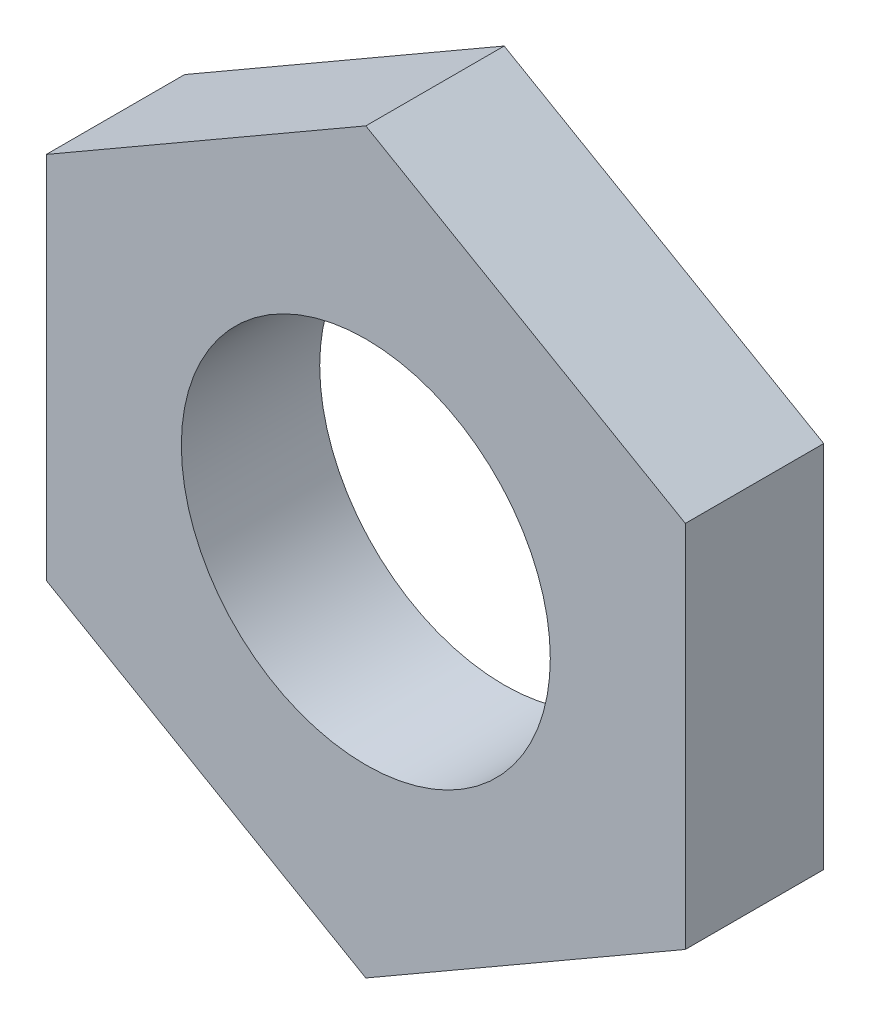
from build123d import *

# Parameters (mm, degrees)
SKETCH1_R           = 20
BOSS_EXTRUDE1_DEPTH = 7.5


with BuildPart() as part:
    # Sketch1 → Boss-Extrude1 (new, symmetric)
    with BuildSketch(Plane.XY):
        Polygon((-34.641016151, 20), (-34.641016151, -20), (0, -40), (34.641016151, -20), (34.641016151, 20), (0, 40), align=None)
        Circle(SKETCH1_R, mode=Mode.SUBTRACT)
    extrude(amount=BOSS_EXTRUDE1_DEPTH, both=True)


solid = part.part
